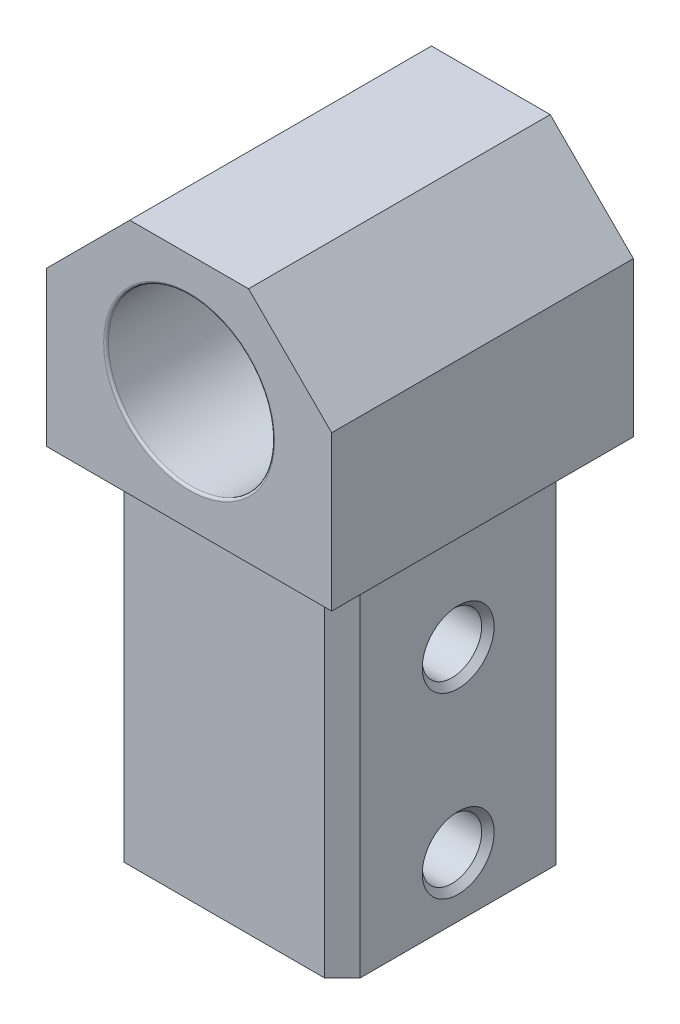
from build123d import *

# Parameters (mm, degrees)
ESQUISSE1_W                = 19.9
ESQUISSE1_H                = 19.5
BOSS_EXTRU_1_DEPTH         = 30
ESQUISSE3_W                = 24
ESQUISSE3_H                = 25.4
BOSS_EXTRU_2_DEPTH         = 20
TROU_TARAUD_M61_AT_2_COUNT = 2
TROU_TARAUD_M61_AT_2_PITCH = 15
CHANFREIN5_SIZE            = 1.5
ESQUISSE16_R               = 7
ENL_V_MAT_EXTRU_1_DEPTH    = 42.099391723
CONG_1_R                   = 0.2
CHANFREIN6_SIZE            = 7


with BuildPart() as part:
    # Esquisse1 → Boss.-Extru.1 (new body)
    with BuildSketch(Plane(origin=(0, 0, 0), x_dir=(1, 0, 0), z_dir=(0, 1, 0))):
        Rectangle(ESQUISSE1_W, ESQUISSE1_H)
    extrude(amount=-BOSS_EXTRU_1_DEPTH)

    # Esquisse3 → Boss.-Extru.2 (add)
    with BuildSketch(Plane(origin=(0, 0, 0), x_dir=(1, 0, 0), z_dir=(0, 1, 0))):
        Rectangle(ESQUISSE3_W, ESQUISSE3_H)
    extrude(amount=BOSS_EXTRU_2_DEPTH)

    # Esquisse10 → Trou taraud_ M61 (revolve, cut)
    with BuildSketch(Plane(origin=(9.95, -10, 0), x_dir=(0, 0, -1), z_dir=(0, 1, 0))):
        Polygon((0, 0), (0, 19.9), (3.025, 19.9), (2.5, 19.375), (2.5, 0.525), (3.025, 0), align=None)
    trou_taraud_m61 = revolve(axis=Axis((16.3, -10, 0), (-1, 0, 0)), mode=Mode.SUBTRACT)

    # Trou taraud_ M61 at 2: Trou taraud_ M61 ×2
    with Locations(*[(0, -i * TROU_TARAUD_M61_AT_2_PITCH, 0) for i in range(1, TROU_TARAUD_M61_AT_2_COUNT)]):
        add(trou_taraud_m61, mode=Mode.SUBTRACT)

    # Chanfrein5
    chanfrein5_edges = [part.edges().sort_by_distance(p)[0] for p in [
        (9.95, -15, 9.75),
        (-9.95, -15, 9.75),
        (-9.95, -15, -9.75),
        (9.95, -15, -9.75),
    ]]
    chamfer(chanfrein5_edges, length=CHANFREIN5_SIZE)

    # Esquisse16 → Enl_v. mat.-Extru.1 (cut, through all)
    with BuildSketch(Plane.XY.offset(12.7)):
        with Locations((0, 10)):
            Circle(ESQUISSE16_R)
    extrude(amount=-ENL_V_MAT_EXTRU_1_DEPTH, mode=Mode.SUBTRACT)

    # Cong_1
    cong_1_edges = [part.edges().sort_by_distance(p)[0] for p in [
        (-7, 10, -12.7),
        (-7, 10, 12.7),
    ]]
    fillet(cong_1_edges, radius=CONG_1_R)

    # Chanfrein6
    chanfrein6_edges = [part.edges().sort_by_distance(p)[0] for p in [
        (12, 20, 0),
        (-12, 20, 0),
    ]]
    chamfer(chanfrein6_edges, length=CHANFREIN6_SIZE)


solid = part.part
